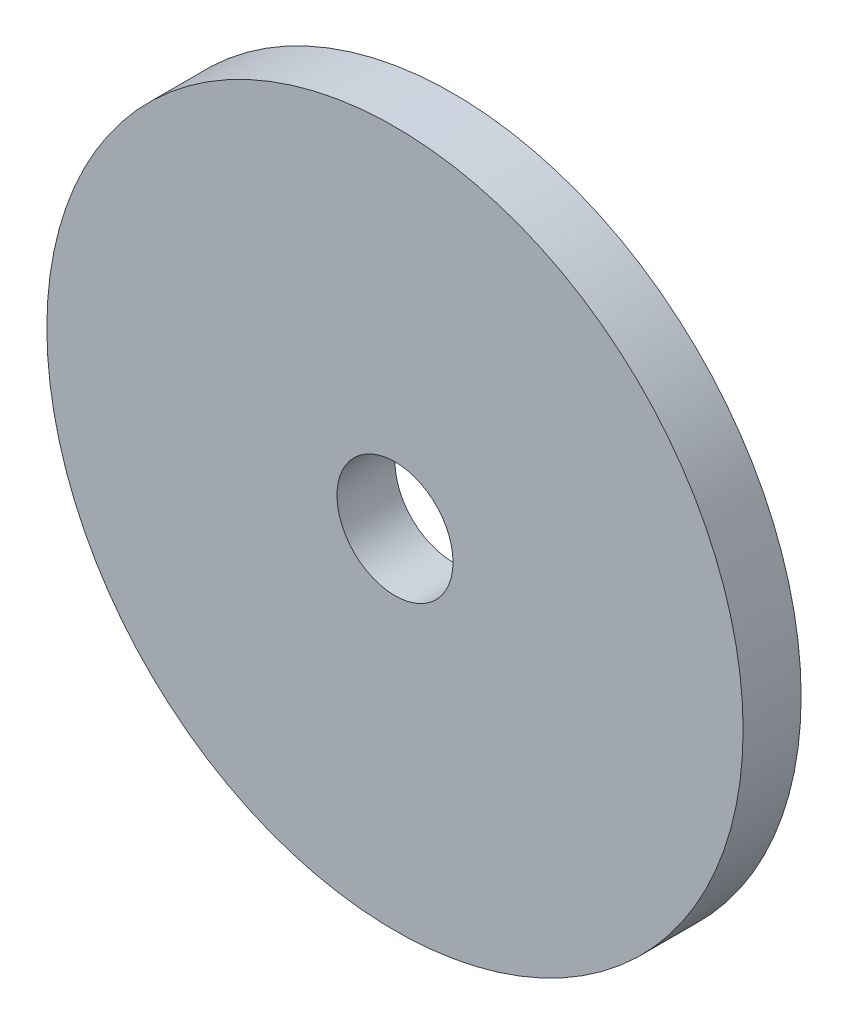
from build123d import *

# Parameters (mm, degrees)
SKETCH1_R           = 19.05
SKETCH1_R_2         = 3.175
BOSS_EXTRUDE1_DEPTH = 3.175


with BuildPart() as part:
    # Sketch1 → Boss-Extrude1 (new body)
    with BuildSketch(Plane.XY):
        Circle(SKETCH1_R)
        Circle(SKETCH1_R_2, mode=Mode.SUBTRACT)
    extrude(amount=BOSS_EXTRUDE1_DEPTH)


solid = part.part
